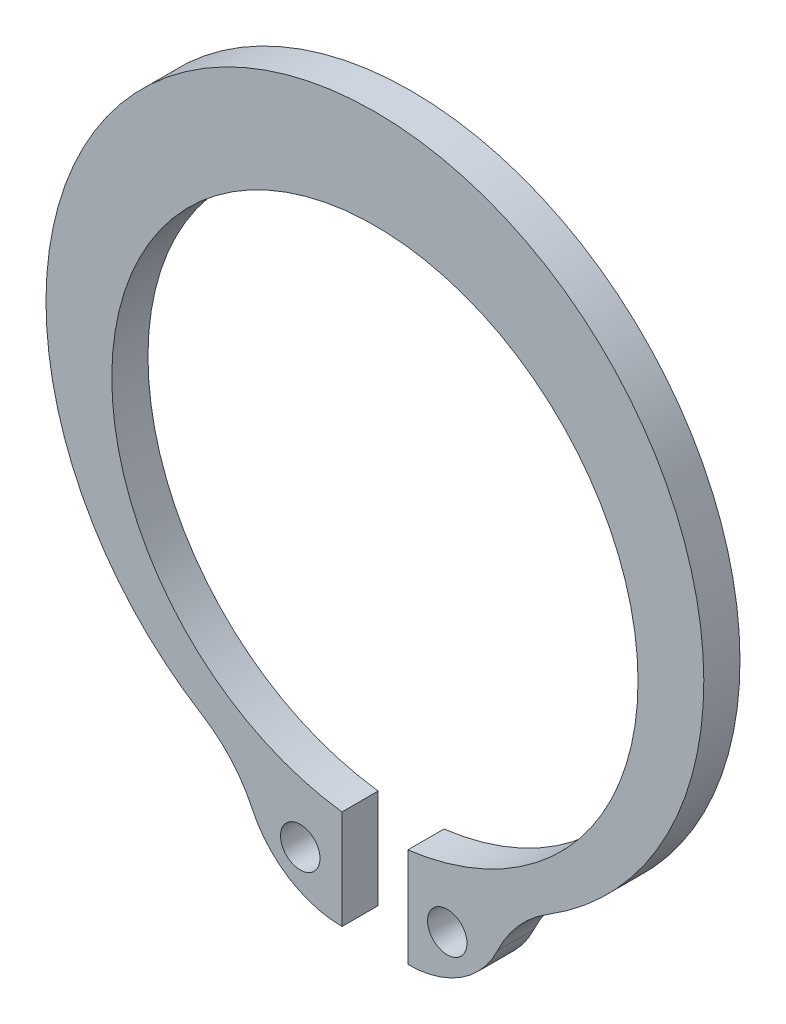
ISO-10303-21;
HEADER;
FILE_DESCRIPTION(('STEP AP214'),'2;1');
FILE_NAME('part.step','',(''),(''),'','','');
FILE_SCHEMA(('AUTOMOTIVE_DESIGN { 1 0 10303 214 1 1 1 1 }'));
ENDSEC;
DATA;
#1=APPLICATION_CONTEXT('core data for automotive mechanical design processes');
#2=APPLICATION_PROTOCOL_DEFINITION('international standard','automotive_design',2000,#1);
#3=PRODUCT_CONTEXT('',#1,'mechanical');
#4=PRODUCT('Part','Part','',(#3));
#5=PRODUCT_RELATED_PRODUCT_CATEGORY('part','',(#4));
#6=PRODUCT_DEFINITION_FORMATION('','',#4);
#7=PRODUCT_DEFINITION_CONTEXT('part definition',#1,'design');
#8=PRODUCT_DEFINITION('design','',#6,#7);
#9=PRODUCT_DEFINITION_SHAPE('','',#8);
#10=(LENGTH_UNIT() NAMED_UNIT(*) SI_UNIT(.MILLI.,.METRE.));
#11=(NAMED_UNIT(*) PLANE_ANGLE_UNIT() SI_UNIT($,.RADIAN.));
#12=(NAMED_UNIT(*) SI_UNIT($,.STERADIAN.) SOLID_ANGLE_UNIT());
#13=UNCERTAINTY_MEASURE_WITH_UNIT(LENGTH_MEASURE(1.E-05),#10,'distance_accuracy_value','');
#14=(GEOMETRIC_REPRESENTATION_CONTEXT(3) GLOBAL_UNCERTAINTY_ASSIGNED_CONTEXT((#13)) GLOBAL_UNIT_ASSIGNED_CONTEXT((#10,
#11,#12)) REPRESENTATION_CONTEXT('',''));
#15=CARTESIAN_POINT('',(0.,0.,0.));
#16=DIRECTION('',(0.,0.,1.));
#17=DIRECTION('',(1.,0.,0.));
#18=AXIS2_PLACEMENT_3D('',#15,#16,#17);
#19=CARTESIAN_POINT('',(7.35542737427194,-10.9120816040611,1.10000000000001));
#20=DIRECTION('',(0.,0.,-1.));
#21=DIRECTION('',(-1.,0.,0.));
#22=AXIS2_PLACEMENT_3D('',#19,#20,#21);
#23=PLANE('',#22);
#24=CARTESIAN_POINT('',(2.2,-9.5,1.1));
#25=DIRECTION('',(0.,0.,1.));
#26=DIRECTION('',(1.,0.,0.));
#27=AXIS2_PLACEMENT_3D('',#24,#25,#26);
#28=CIRCLE('',#27,0.6);
#29=CARTESIAN_POINT('',(2.8,-9.5,1.1));
#30=VERTEX_POINT('',#29);
#31=EDGE_CURVE('E115',#30,#30,#28,.T.);
#32=ORIENTED_EDGE('',*,*,#31,.F.);
#33=EDGE_LOOP('',(#32));
#34=FACE_BOUND('',#33,.T.);
#35=CARTESIAN_POINT('',(7.35542737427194,-10.9120816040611,1.10000000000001));
#36=DIRECTION('',(0.,0.,-1.));
#37=DIRECTION('',(-1.,0.,0.));
#38=AXIS2_PLACEMENT_3D('',#35,#36,#37);
#39=CIRCLE('',#38,4.);
#40=CARTESIAN_POINT('',(3.73265481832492,-9.21634606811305,1.1));
#41=VERTEX_POINT('',#40);
#42=CARTESIAN_POINT('',(5.25387669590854,-7.50862971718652,1.10000000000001));
#43=VERTEX_POINT('',#42);
#44=EDGE_CURVE('E133',#41,#43,#39,.T.);
#45=ORIENTED_EDGE('',*,*,#44,.T.);
#46=CARTESIAN_POINT('',(0.,1.,1.10000000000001));
#47=DIRECTION('',(0.,0.,1.));
#48=DIRECTION('',(1.,0.,0.));
#49=AXIS2_PLACEMENT_3D('',#46,#47,#48);
#50=CIRCLE('',#49,10.);
#51=CARTESIAN_POINT('',(-5.25387669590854,-7.50862971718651,1.1));
#52=VERTEX_POINT('',#51);
#53=EDGE_CURVE('E110',#43,#52,#50,.T.);
#54=ORIENTED_EDGE('',*,*,#53,.T.);
#55=CARTESIAN_POINT('',(-7.35542737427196,-10.9120816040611,1.10000000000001));
#56=DIRECTION('',(0.,0.,-1.));
#57=DIRECTION('',(1.,0.,0.));
#58=AXIS2_PLACEMENT_3D('',#55,#56,#57);
#59=CIRCLE('',#58,4.);
#60=CARTESIAN_POINT('',(-3.73265481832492,-9.21634606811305,1.1));
#61=VERTEX_POINT('',#60);
#62=EDGE_CURVE('E136',#52,#61,#59,.T.);
#63=ORIENTED_EDGE('',*,*,#62,.T.);
#64=CARTESIAN_POINT('',(-1.,-7.93725393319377,1.10000000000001));
#65=DIRECTION('',(0.,0.,1.));
#66=DIRECTION('',(1.,0.,0.));
#67=AXIS2_PLACEMENT_3D('',#64,#65,#66);
#68=CIRCLE('',#67,3.01719721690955);
#69=CARTESIAN_POINT('',(-1.,-10.9544511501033,1.1));
#70=VERTEX_POINT('',#69);
#71=EDGE_CURVE('E138',#61,#70,#68,.T.);
#72=ORIENTED_EDGE('',*,*,#71,.T.);
#73=DIRECTION('',(0.,1.,0.));
#74=VECTOR('',#73,1.);
#75=CARTESIAN_POINT('',(-1.,-7.93725393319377,1.10000000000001));
#76=LINE('',#75,#74);
#77=CARTESIAN_POINT('',(-1.00000000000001,-7.93725393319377,1.10000000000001));
#78=VERTEX_POINT('',#77);
#79=EDGE_CURVE('E140',#70,#78,#76,.T.);
#80=ORIENTED_EDGE('',*,*,#79,.T.);
#81=CARTESIAN_POINT('',(0.,0.,1.1));
#82=DIRECTION('',(0.,0.,-1.));
#83=DIRECTION('',(1.,0.,0.));
#84=AXIS2_PLACEMENT_3D('',#81,#82,#83);
#85=CIRCLE('',#84,8.);
#86=CARTESIAN_POINT('',(0.999999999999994,-7.9372539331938,1.10000000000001));
#87=VERTEX_POINT('',#86);
#88=EDGE_CURVE('E142',#78,#87,#85,.T.);
#89=ORIENTED_EDGE('',*,*,#88,.T.);
#90=DIRECTION('',(0.,-1.,0.));
#91=VECTOR('',#90,1.);
#92=CARTESIAN_POINT('',(0.999999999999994,-7.9372539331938,1.10000000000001));
#93=LINE('',#92,#91);
#94=CARTESIAN_POINT('',(0.999999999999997,-10.9544511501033,1.1));
#95=VERTEX_POINT('',#94);
#96=EDGE_CURVE('E51',#87,#95,#93,.T.);
#97=ORIENTED_EDGE('',*,*,#96,.T.);
#98=CARTESIAN_POINT('',(0.999999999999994,-7.9372539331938,1.10000000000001));
#99=DIRECTION('',(0.,0.,1.));
#100=DIRECTION('',(1.,0.,0.));
#101=AXIS2_PLACEMENT_3D('',#98,#99,#100);
#102=CIRCLE('',#101,3.01719721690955);
#103=EDGE_CURVE('E46',#95,#41,#102,.T.);
#104=ORIENTED_EDGE('',*,*,#103,.T.);
#105=EDGE_LOOP('',(#45,#54,#63,#72,#80,#89,#97,#104));
#106=FACE_BOUND('',#105,.T.);
#107=CARTESIAN_POINT('',(-2.27,-9.50000000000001,1.10000000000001));
#108=DIRECTION('',(0.,0.,1.));
#109=DIRECTION('',(1.,0.,0.));
#110=AXIS2_PLACEMENT_3D('',#107,#108,#109);
#111=CIRCLE('',#110,0.6);
#112=CARTESIAN_POINT('',(-1.67,-9.50000000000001,1.10000000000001));
#113=VERTEX_POINT('',#112);
#114=EDGE_CURVE('E213',#113,#113,#111,.T.);
#115=ORIENTED_EDGE('',*,*,#114,.F.);
#116=EDGE_LOOP('',(#115));
#117=FACE_BOUND('',#116,.T.);
#118=ADVANCED_FACE('F31',(#34,#106,#117),#23,.F.);
#119=CARTESIAN_POINT('',(7.35542737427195,-10.9120816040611,0.));
#120=DIRECTION('',(0.,0.,-1.));
#121=DIRECTION('',(-1.,0.,0.));
#122=AXIS2_PLACEMENT_3D('',#119,#120,#121);
#123=PLANE('',#122);
#124=CARTESIAN_POINT('',(2.19999999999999,-9.50000000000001,0.));
#125=DIRECTION('',(0.,0.,1.));
#126=DIRECTION('',(1.,0.,0.));
#127=AXIS2_PLACEMENT_3D('',#124,#125,#126);
#128=CIRCLE('',#127,0.6);
#129=CARTESIAN_POINT('',(2.79999999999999,-9.50000000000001,0.));
#130=VERTEX_POINT('',#129);
#131=EDGE_CURVE('E118',#130,#130,#128,.T.);
#132=ORIENTED_EDGE('',*,*,#131,.T.);
#133=EDGE_LOOP('',(#132));
#134=FACE_BOUND('',#133,.T.);
#135=CARTESIAN_POINT('',(7.35542737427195,-10.9120816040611,0.));
#136=DIRECTION('',(0.,0.,-1.));
#137=DIRECTION('',(-1.,0.,0.));
#138=AXIS2_PLACEMENT_3D('',#135,#136,#137);
#139=CIRCLE('',#138,4.);
#140=CARTESIAN_POINT('',(3.73265481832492,-9.21634606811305,0.));
#141=VERTEX_POINT('',#140);
#142=CARTESIAN_POINT('',(5.25387669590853,-7.50862971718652,0.));
#143=VERTEX_POINT('',#142);
#144=EDGE_CURVE('E101',#141,#143,#139,.T.);
#145=ORIENTED_EDGE('',*,*,#144,.F.);
#146=CARTESIAN_POINT('',(0.999999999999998,-7.93725393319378,0.));
#147=DIRECTION('',(0.,0.,1.));
#148=DIRECTION('',(1.,0.,0.));
#149=AXIS2_PLACEMENT_3D('',#146,#147,#148);
#150=CIRCLE('',#149,3.01719721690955);
#151=CARTESIAN_POINT('',(1.,-10.9544511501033,0.));
#152=VERTEX_POINT('',#151);
#153=EDGE_CURVE('E131',#152,#141,#150,.T.);
#154=ORIENTED_EDGE('',*,*,#153,.F.);
#155=DIRECTION('',(0.,-1.,0.));
#156=VECTOR('',#155,1.);
#157=CARTESIAN_POINT('',(0.999999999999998,-7.93725393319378,0.));
#158=LINE('',#157,#156);
#159=CARTESIAN_POINT('',(0.999999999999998,-7.93725393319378,0.));
#160=VERTEX_POINT('',#159);
#161=EDGE_CURVE('E129',#160,#152,#158,.T.);
#162=ORIENTED_EDGE('',*,*,#161,.F.);
#163=CARTESIAN_POINT('',(0.,0.,0.));
#164=DIRECTION('',(0.,0.,-1.));
#165=DIRECTION('',(1.,0.,0.));
#166=AXIS2_PLACEMENT_3D('',#163,#164,#165);
#167=CIRCLE('',#166,8.);
#168=CARTESIAN_POINT('',(-1.00000000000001,-7.93725393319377,0.));
#169=VERTEX_POINT('',#168);
#170=EDGE_CURVE('E127',#169,#160,#167,.T.);
#171=ORIENTED_EDGE('',*,*,#170,.F.);
#172=DIRECTION('',(0.,1.,0.));
#173=VECTOR('',#172,1.);
#174=CARTESIAN_POINT('',(-0.999999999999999,-7.93725393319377,0.));
#175=LINE('',#174,#173);
#176=CARTESIAN_POINT('',(-0.999999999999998,-10.9544511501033,0.));
#177=VERTEX_POINT('',#176);
#178=EDGE_CURVE('E125',#177,#169,#175,.T.);
#179=ORIENTED_EDGE('',*,*,#178,.F.);
#180=CARTESIAN_POINT('',(-0.999999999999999,-7.93725393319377,0.));
#181=DIRECTION('',(0.,0.,1.));
#182=DIRECTION('',(1.,0.,0.));
#183=AXIS2_PLACEMENT_3D('',#180,#181,#182);
#184=CIRCLE('',#183,3.01719721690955);
#185=CARTESIAN_POINT('',(-3.73265481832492,-9.21634606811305,0.));
#186=VERTEX_POINT('',#185);
#187=EDGE_CURVE('E123',#186,#177,#184,.T.);
#188=ORIENTED_EDGE('',*,*,#187,.F.);
#189=CARTESIAN_POINT('',(-7.35542737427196,-10.9120816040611,0.));
#190=DIRECTION('',(0.,0.,-1.));
#191=DIRECTION('',(1.,0.,0.));
#192=AXIS2_PLACEMENT_3D('',#189,#190,#191);
#193=CIRCLE('',#192,4.);
#194=CARTESIAN_POINT('',(-5.25387669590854,-7.50862971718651,0.));
#195=VERTEX_POINT('',#194);
#196=EDGE_CURVE('E103',#195,#186,#193,.T.);
#197=ORIENTED_EDGE('',*,*,#196,.F.);
#198=CARTESIAN_POINT('',(0.,1.,0.));
#199=DIRECTION('',(0.,0.,1.));
#200=DIRECTION('',(1.,0.,0.));
#201=AXIS2_PLACEMENT_3D('',#198,#199,#200);
#202=CIRCLE('',#201,10.);
#203=EDGE_CURVE('E96',#143,#195,#202,.T.);
#204=ORIENTED_EDGE('',*,*,#203,.F.);
#205=EDGE_LOOP('',(#145,#154,#162,#171,#179,#188,#197,#204));
#206=FACE_BOUND('',#205,.T.);
#207=CARTESIAN_POINT('',(-2.27,-9.50000000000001,0.));
#208=DIRECTION('',(0.,0.,1.));
#209=DIRECTION('',(1.,0.,0.));
#210=AXIS2_PLACEMENT_3D('',#207,#208,#209);
#211=CIRCLE('',#210,0.6);
#212=CARTESIAN_POINT('',(-1.67,-9.50000000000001,0.));
#213=VERTEX_POINT('',#212);
#214=EDGE_CURVE('E216',#213,#213,#211,.T.);
#215=ORIENTED_EDGE('',*,*,#214,.T.);
#216=EDGE_LOOP('',(#215));
#217=FACE_BOUND('',#216,.T.);
#218=ADVANCED_FACE('F97',(#134,#206,#217),#123,.T.);
#219=CARTESIAN_POINT('',(7.35542737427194,-10.9120816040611,1.10000000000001));
#220=DIRECTION('',(0.,0.,-1.));
#221=DIRECTION('',(-1.,0.,0.));
#222=AXIS2_PLACEMENT_3D('',#219,#220,#221);
#223=CYLINDRICAL_SURFACE('',#222,4.);
#224=ORIENTED_EDGE('',*,*,#144,.T.);
#225=DIRECTION('',(0.,0.,-1.));
#226=VECTOR('',#225,1.);
#227=CARTESIAN_POINT('',(5.25387669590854,-7.50862971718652,1.10000000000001));
#228=LINE('',#227,#226);
#229=EDGE_CURVE('E11',#43,#143,#228,.T.);
#230=ORIENTED_EDGE('',*,*,#229,.F.);
#231=ORIENTED_EDGE('',*,*,#44,.F.);
#232=DIRECTION('',(0.,0.,-1.));
#233=VECTOR('',#232,1.);
#234=CARTESIAN_POINT('',(3.73265481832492,-9.21634606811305,1.1));
#235=LINE('',#234,#233);
#236=EDGE_CURVE('E114',#41,#141,#235,.T.);
#237=ORIENTED_EDGE('',*,*,#236,.T.);
#238=EDGE_LOOP('',(#224,#230,#231,#237));
#239=FACE_BOUND('',#238,.T.);
#240=ADVANCED_FACE('F33',(#239),#223,.F.);
#241=CARTESIAN_POINT('',(0.,1.,1.10000000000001));
#242=DIRECTION('',(0.,0.,-1.));
#243=DIRECTION('',(-1.,0.,0.));
#244=AXIS2_PLACEMENT_3D('',#241,#242,#243);
#245=CYLINDRICAL_SURFACE('',#244,10.);
#246=ORIENTED_EDGE('',*,*,#203,.T.);
#247=DIRECTION('',(0.,0.,-1.));
#248=VECTOR('',#247,1.);
#249=CARTESIAN_POINT('',(-5.25387669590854,-7.50862971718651,1.1));
#250=LINE('',#249,#248);
#251=EDGE_CURVE('E39',#52,#195,#250,.T.);
#252=ORIENTED_EDGE('',*,*,#251,.F.);
#253=ORIENTED_EDGE('',*,*,#53,.F.);
#254=ORIENTED_EDGE('',*,*,#229,.T.);
#255=EDGE_LOOP('',(#246,#252,#253,#254));
#256=FACE_BOUND('',#255,.T.);
#257=ADVANCED_FACE('F109',(#256),#245,.T.);
#258=CARTESIAN_POINT('',(-7.35542737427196,-10.9120816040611,1.10000000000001));
#259=DIRECTION('',(0.,0.,-1.));
#260=DIRECTION('',(-1.,0.,0.));
#261=AXIS2_PLACEMENT_3D('',#258,#259,#260);
#262=CYLINDRICAL_SURFACE('',#261,4.);
#263=ORIENTED_EDGE('',*,*,#196,.T.);
#264=DIRECTION('',(0.,0.,-1.));
#265=VECTOR('',#264,1.);
#266=CARTESIAN_POINT('',(-3.73265481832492,-9.21634606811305,1.1));
#267=LINE('',#266,#265);
#268=EDGE_CURVE('E159',#61,#186,#267,.T.);
#269=ORIENTED_EDGE('',*,*,#268,.F.);
#270=ORIENTED_EDGE('',*,*,#62,.F.);
#271=ORIENTED_EDGE('',*,*,#251,.T.);
#272=EDGE_LOOP('',(#263,#269,#270,#271));
#273=FACE_BOUND('',#272,.T.);
#274=ADVANCED_FACE('F163',(#273),#262,.F.);
#275=CARTESIAN_POINT('',(-1.,-7.93725393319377,1.10000000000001));
#276=DIRECTION('',(0.,0.,-1.));
#277=DIRECTION('',(-1.,0.,0.));
#278=AXIS2_PLACEMENT_3D('',#275,#276,#277);
#279=CYLINDRICAL_SURFACE('',#278,3.01719721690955);
#280=ORIENTED_EDGE('',*,*,#187,.T.);
#281=DIRECTION('',(0.,0.,-1.));
#282=VECTOR('',#281,1.);
#283=CARTESIAN_POINT('',(-1.,-10.9544511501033,1.1));
#284=LINE('',#283,#282);
#285=EDGE_CURVE('E156',#70,#177,#284,.T.);
#286=ORIENTED_EDGE('',*,*,#285,.F.);
#287=ORIENTED_EDGE('',*,*,#71,.F.);
#288=ORIENTED_EDGE('',*,*,#268,.T.);
#289=EDGE_LOOP('',(#280,#286,#287,#288));
#290=FACE_BOUND('',#289,.T.);
#291=ADVANCED_FACE('F171',(#290),#279,.T.);
#292=CARTESIAN_POINT('',(-1.,-7.93725393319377,1.10000000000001));
#293=DIRECTION('',(-1.,0.,0.));
#294=DIRECTION('',(0.,-1.,0.));
#295=AXIS2_PLACEMENT_3D('',#292,#293,#294);
#296=PLANE('',#295);
#297=ORIENTED_EDGE('',*,*,#178,.T.);
#298=DIRECTION('',(0.,0.,-1.));
#299=VECTOR('',#298,1.);
#300=CARTESIAN_POINT('',(-1.00000000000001,-7.93725393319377,1.10000000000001));
#301=LINE('',#300,#299);
#302=EDGE_CURVE('E153',#78,#169,#301,.T.);
#303=ORIENTED_EDGE('',*,*,#302,.F.);
#304=ORIENTED_EDGE('',*,*,#79,.F.);
#305=ORIENTED_EDGE('',*,*,#285,.T.);
#306=EDGE_LOOP('',(#297,#303,#304,#305));
#307=FACE_BOUND('',#306,.T.);
#308=ADVANCED_FACE('F174',(#307),#296,.F.);
#309=CARTESIAN_POINT('',(0.,0.,1.1));
#310=DIRECTION('',(0.,0.,-1.));
#311=DIRECTION('',(-1.,0.,0.));
#312=AXIS2_PLACEMENT_3D('',#309,#310,#311);
#313=CYLINDRICAL_SURFACE('',#312,8.);
#314=ORIENTED_EDGE('',*,*,#170,.T.);
#315=DIRECTION('',(0.,0.,-1.));
#316=VECTOR('',#315,1.);
#317=CARTESIAN_POINT('',(0.999999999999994,-7.9372539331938,1.10000000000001));
#318=LINE('',#317,#316);
#319=EDGE_CURVE('E150',#87,#160,#318,.T.);
#320=ORIENTED_EDGE('',*,*,#319,.F.);
#321=ORIENTED_EDGE('',*,*,#88,.F.);
#322=ORIENTED_EDGE('',*,*,#302,.T.);
#323=EDGE_LOOP('',(#314,#320,#321,#322));
#324=FACE_BOUND('',#323,.T.);
#325=ADVANCED_FACE('F179',(#324),#313,.F.);
#326=CARTESIAN_POINT('',(0.999999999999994,-7.9372539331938,1.10000000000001));
#327=DIRECTION('',(1.,0.,0.));
#328=DIRECTION('',(0.,1.,0.));
#329=AXIS2_PLACEMENT_3D('',#326,#327,#328);
#330=PLANE('',#329);
#331=ORIENTED_EDGE('',*,*,#161,.T.);
#332=DIRECTION('',(0.,0.,-1.));
#333=VECTOR('',#332,1.);
#334=CARTESIAN_POINT('',(0.999999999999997,-10.9544511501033,1.1));
#335=LINE('',#334,#333);
#336=EDGE_CURVE('E147',#95,#152,#335,.T.);
#337=ORIENTED_EDGE('',*,*,#336,.F.);
#338=ORIENTED_EDGE('',*,*,#96,.F.);
#339=ORIENTED_EDGE('',*,*,#319,.T.);
#340=EDGE_LOOP('',(#331,#337,#338,#339));
#341=FACE_BOUND('',#340,.T.);
#342=ADVANCED_FACE('F182',(#341),#330,.F.);
#343=CARTESIAN_POINT('',(0.999999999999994,-7.9372539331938,1.10000000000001));
#344=DIRECTION('',(0.,0.,-1.));
#345=DIRECTION('',(-1.,0.,0.));
#346=AXIS2_PLACEMENT_3D('',#343,#344,#345);
#347=CYLINDRICAL_SURFACE('',#346,3.01719721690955);
#348=ORIENTED_EDGE('',*,*,#153,.T.);
#349=ORIENTED_EDGE('',*,*,#236,.F.);
#350=ORIENTED_EDGE('',*,*,#103,.F.);
#351=ORIENTED_EDGE('',*,*,#336,.T.);
#352=EDGE_LOOP('',(#348,#349,#350,#351));
#353=FACE_BOUND('',#352,.T.);
#354=ADVANCED_FACE('F184',(#353),#347,.T.);
#355=CARTESIAN_POINT('',(2.2,-9.5,1.1));
#356=DIRECTION('',(0.,0.,-1.));
#357=DIRECTION('',(-1.,0.,0.));
#358=AXIS2_PLACEMENT_3D('',#355,#356,#357);
#359=CYLINDRICAL_SURFACE('',#358,0.6);
#360=ORIENTED_EDGE('',*,*,#31,.T.);
#361=EDGE_LOOP('',(#360));
#362=FACE_BOUND('',#361,.T.);
#363=ORIENTED_EDGE('',*,*,#131,.F.);
#364=EDGE_LOOP('',(#363));
#365=FACE_BOUND('',#364,.T.);
#366=ADVANCED_FACE('F186',(#362,#365),#359,.F.);
#367=CARTESIAN_POINT('',(-2.27,-9.50000000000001,1.10000000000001));
#368=DIRECTION('',(0.,0.,-1.));
#369=DIRECTION('',(-1.,0.,0.));
#370=AXIS2_PLACEMENT_3D('',#367,#368,#369);
#371=CYLINDRICAL_SURFACE('',#370,0.6);
#372=ORIENTED_EDGE('',*,*,#114,.T.);
#373=EDGE_LOOP('',(#372));
#374=FACE_BOUND('',#373,.T.);
#375=ORIENTED_EDGE('',*,*,#214,.F.);
#376=EDGE_LOOP('',(#375));
#377=FACE_BOUND('',#376,.T.);
#378=ADVANCED_FACE('F192',(#374,#377),#371,.F.);
#379=CLOSED_SHELL('',(#118,#218,#240,#257,#274,#291,#308,#325,#342,#354,#366,#378));
#380=MANIFOLD_SOLID_BREP('B2',#379);
#381=ADVANCED_BREP_SHAPE_REPRESENTATION('',(#18,#380),#14);
#382=SHAPE_DEFINITION_REPRESENTATION(#9,#381);
ENDSEC;
END-ISO-10303-21;
